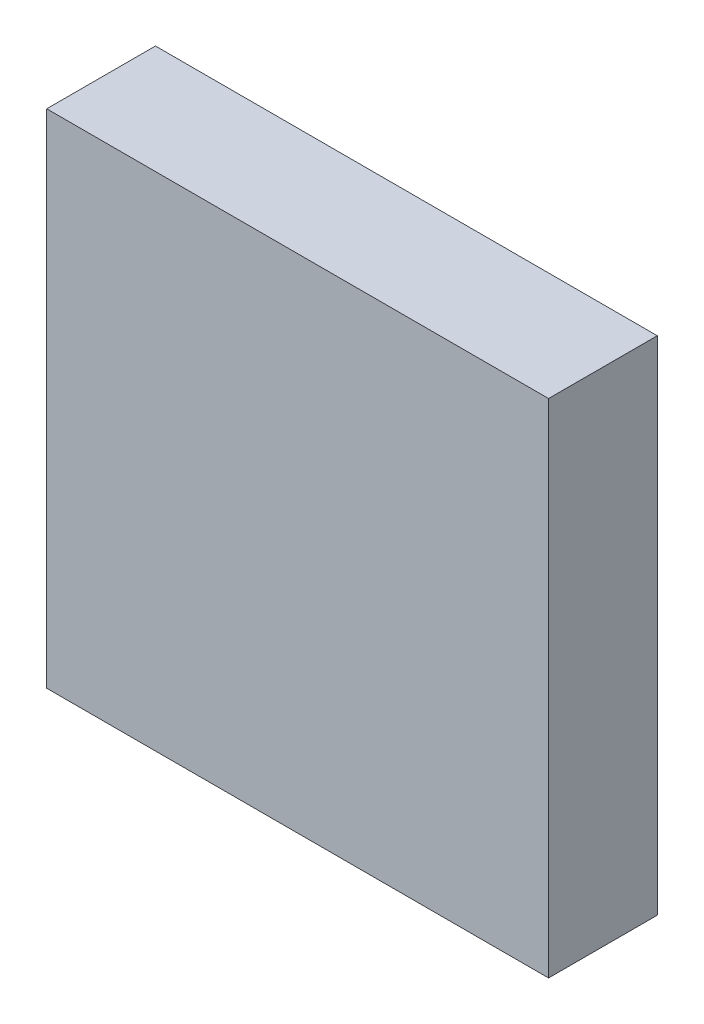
ISO-10303-21;
HEADER;
FILE_DESCRIPTION(('STEP AP214'),'2;1');
FILE_NAME('part.step','',(''),(''),'','','');
FILE_SCHEMA(('AUTOMOTIVE_DESIGN { 1 0 10303 214 1 1 1 1 }'));
ENDSEC;
DATA;
#1=APPLICATION_CONTEXT('core data for automotive mechanical design processes');
#2=APPLICATION_PROTOCOL_DEFINITION('international standard','automotive_design',2000,#1);
#3=PRODUCT_CONTEXT('',#1,'mechanical');
#4=PRODUCT('Part','Part','',(#3));
#5=PRODUCT_RELATED_PRODUCT_CATEGORY('part','',(#4));
#6=PRODUCT_DEFINITION_FORMATION('','',#4);
#7=PRODUCT_DEFINITION_CONTEXT('part definition',#1,'design');
#8=PRODUCT_DEFINITION('design','',#6,#7);
#9=PRODUCT_DEFINITION_SHAPE('','',#8);
#10=(LENGTH_UNIT() NAMED_UNIT(*) SI_UNIT(.MILLI.,.METRE.));
#11=(NAMED_UNIT(*) PLANE_ANGLE_UNIT() SI_UNIT($,.RADIAN.));
#12=(NAMED_UNIT(*) SI_UNIT($,.STERADIAN.) SOLID_ANGLE_UNIT());
#13=UNCERTAINTY_MEASURE_WITH_UNIT(LENGTH_MEASURE(1.E-05),#10,'distance_accuracy_value','');
#14=(GEOMETRIC_REPRESENTATION_CONTEXT(3) GLOBAL_UNCERTAINTY_ASSIGNED_CONTEXT((#13)) GLOBAL_UNIT_ASSIGNED_CONTEXT((#10,
#11,#12)) REPRESENTATION_CONTEXT('',''));
#15=CARTESIAN_POINT('',(0.,0.,0.));
#16=DIRECTION('',(0.,0.,1.));
#17=DIRECTION('',(1.,0.,0.));
#18=AXIS2_PLACEMENT_3D('',#15,#16,#17);
#19=CARTESIAN_POINT('',(3.,0.,0.65));
#20=DIRECTION('',(0.,0.,-1.));
#21=DIRECTION('',(-1.,0.,0.));
#22=AXIS2_PLACEMENT_3D('',#19,#20,#21);
#23=PLANE('',#22);
#24=DIRECTION('',(1.,0.,0.));
#25=VECTOR('',#24,1.);
#26=CARTESIAN_POINT('',(1.5,0.,0.65));
#27=LINE('',#26,#25);
#28=CARTESIAN_POINT('',(0.,0.,0.65));
#29=VERTEX_POINT('',#28);
#30=CARTESIAN_POINT('',(3.,0.,0.65));
#31=VERTEX_POINT('',#30);
#32=EDGE_CURVE('E80',#29,#31,#27,.T.);
#33=ORIENTED_EDGE('',*,*,#32,.T.);
#34=DIRECTION('',(0.,1.,0.));
#35=VECTOR('',#34,1.);
#36=CARTESIAN_POINT('',(3.,1.5,0.65));
#37=LINE('',#36,#35);
#38=CARTESIAN_POINT('',(3.,3.,0.65));
#39=VERTEX_POINT('',#38);
#40=EDGE_CURVE('E55',#31,#39,#37,.T.);
#41=ORIENTED_EDGE('',*,*,#40,.T.);
#42=DIRECTION('',(-1.,0.,0.));
#43=VECTOR('',#42,1.);
#44=CARTESIAN_POINT('',(1.5,3.,0.65));
#45=LINE('',#44,#43);
#46=CARTESIAN_POINT('',(0.,3.,0.65));
#47=VERTEX_POINT('',#46);
#48=EDGE_CURVE('E57',#39,#47,#45,.T.);
#49=ORIENTED_EDGE('',*,*,#48,.T.);
#50=DIRECTION('',(0.,-1.,0.));
#51=VECTOR('',#50,1.);
#52=CARTESIAN_POINT('',(0.,1.5,0.65));
#53=LINE('',#52,#51);
#54=EDGE_CURVE('E20',#47,#29,#53,.T.);
#55=ORIENTED_EDGE('',*,*,#54,.T.);
#56=EDGE_LOOP('',(#33,#41,#49,#55));
#57=FACE_BOUND('',#56,.T.);
#58=ADVANCED_FACE('F16',(#57),#23,.F.);
#59=CARTESIAN_POINT('',(0.,0.,0.));
#60=DIRECTION('',(1.,0.,0.));
#61=DIRECTION('',(0.,1.,0.));
#62=AXIS2_PLACEMENT_3D('',#59,#60,#61);
#63=PLANE('',#62);
#64=DIRECTION('',(0.,0.,1.));
#65=VECTOR('',#64,1.);
#66=CARTESIAN_POINT('',(0.,0.,0.325));
#67=LINE('',#66,#65);
#68=CARTESIAN_POINT('',(0.,0.,0.));
#69=VERTEX_POINT('',#68);
#70=EDGE_CURVE('E68',#69,#29,#67,.T.);
#71=ORIENTED_EDGE('',*,*,#70,.T.);
#72=ORIENTED_EDGE('',*,*,#54,.F.);
#73=DIRECTION('',(0.,0.,-1.));
#74=VECTOR('',#73,1.);
#75=CARTESIAN_POINT('',(0.,3.,0.325));
#76=LINE('',#75,#74);
#77=CARTESIAN_POINT('',(0.,3.,0.));
#78=VERTEX_POINT('',#77);
#79=EDGE_CURVE('E63',#47,#78,#76,.T.);
#80=ORIENTED_EDGE('',*,*,#79,.T.);
#81=DIRECTION('',(0.,1.,0.));
#82=VECTOR('',#81,1.);
#83=CARTESIAN_POINT('',(0.,1.5,0.));
#84=LINE('',#83,#82);
#85=EDGE_CURVE('E83',#69,#78,#84,.T.);
#86=ORIENTED_EDGE('',*,*,#85,.F.);
#87=EDGE_LOOP('',(#71,#72,#80,#86));
#88=FACE_BOUND('',#87,.T.);
#89=ADVANCED_FACE('F65',(#88),#63,.F.);
#90=CARTESIAN_POINT('',(0.,3.,0.65));
#91=DIRECTION('',(0.,-1.,0.));
#92=DIRECTION('',(0.,0.,-1.));
#93=AXIS2_PLACEMENT_3D('',#90,#91,#92);
#94=PLANE('',#93);
#95=ORIENTED_EDGE('',*,*,#79,.F.);
#96=ORIENTED_EDGE('',*,*,#48,.F.);
#97=DIRECTION('',(0.,0.,-1.));
#98=VECTOR('',#97,1.);
#99=CARTESIAN_POINT('',(3.,3.,0.325));
#100=LINE('',#99,#98);
#101=CARTESIAN_POINT('',(3.,3.,0.));
#102=VERTEX_POINT('',#101);
#103=EDGE_CURVE('E75',#39,#102,#100,.T.);
#104=ORIENTED_EDGE('',*,*,#103,.T.);
#105=DIRECTION('',(1.,0.,0.));
#106=VECTOR('',#105,1.);
#107=CARTESIAN_POINT('',(1.5,3.,0.));
#108=LINE('',#107,#106);
#109=EDGE_CURVE('E72',#78,#102,#108,.T.);
#110=ORIENTED_EDGE('',*,*,#109,.F.);
#111=EDGE_LOOP('',(#95,#96,#104,#110));
#112=FACE_BOUND('',#111,.T.);
#113=ADVANCED_FACE('F70',(#112),#94,.F.);
#114=CARTESIAN_POINT('',(3.,3.,0.));
#115=DIRECTION('',(-1.,0.,0.));
#116=DIRECTION('',(0.,-1.,0.));
#117=AXIS2_PLACEMENT_3D('',#114,#115,#116);
#118=PLANE('',#117);
#119=ORIENTED_EDGE('',*,*,#103,.F.);
#120=ORIENTED_EDGE('',*,*,#40,.F.);
#121=DIRECTION('',(0.,0.,-1.));
#122=VECTOR('',#121,1.);
#123=CARTESIAN_POINT('',(3.,0.,0.325));
#124=LINE('',#123,#122);
#125=CARTESIAN_POINT('',(3.,0.,0.));
#126=VERTEX_POINT('',#125);
#127=EDGE_CURVE('E35',#31,#126,#124,.T.);
#128=ORIENTED_EDGE('',*,*,#127,.T.);
#129=DIRECTION('',(0.,-1.,0.));
#130=VECTOR('',#129,1.);
#131=CARTESIAN_POINT('',(3.,1.5,0.));
#132=LINE('',#131,#130);
#133=EDGE_CURVE('E26',#102,#126,#132,.T.);
#134=ORIENTED_EDGE('',*,*,#133,.F.);
#135=EDGE_LOOP('',(#119,#120,#128,#134));
#136=FACE_BOUND('',#135,.T.);
#137=ADVANCED_FACE('F88',(#136),#118,.F.);
#138=CARTESIAN_POINT('',(0.,0.,0.));
#139=DIRECTION('',(0.,1.,0.));
#140=DIRECTION('',(0.,0.,1.));
#141=AXIS2_PLACEMENT_3D('',#138,#139,#140);
#142=PLANE('',#141);
#143=ORIENTED_EDGE('',*,*,#127,.F.);
#144=ORIENTED_EDGE('',*,*,#32,.F.);
#145=ORIENTED_EDGE('',*,*,#70,.F.);
#146=DIRECTION('',(-1.,0.,0.));
#147=VECTOR('',#146,1.);
#148=CARTESIAN_POINT('',(1.5,0.,0.));
#149=LINE('',#148,#147);
#150=EDGE_CURVE('E11',#126,#69,#149,.T.);
#151=ORIENTED_EDGE('',*,*,#150,.F.);
#152=EDGE_LOOP('',(#143,#144,#145,#151));
#153=FACE_BOUND('',#152,.T.);
#154=ADVANCED_FACE('F90',(#153),#142,.F.);
#155=CARTESIAN_POINT('',(3.,0.,0.));
#156=DIRECTION('',(0.,0.,-1.));
#157=DIRECTION('',(-1.,0.,0.));
#158=AXIS2_PLACEMENT_3D('',#155,#156,#157);
#159=PLANE('',#158);
#160=ORIENTED_EDGE('',*,*,#133,.T.);
#161=ORIENTED_EDGE('',*,*,#150,.T.);
#162=ORIENTED_EDGE('',*,*,#85,.T.);
#163=ORIENTED_EDGE('',*,*,#109,.T.);
#164=EDGE_LOOP('',(#160,#161,#162,#163));
#165=FACE_BOUND('',#164,.T.);
#166=ADVANCED_FACE('F18',(#165),#159,.T.);
#167=CLOSED_SHELL('',(#58,#89,#113,#137,#154,#166));
#168=MANIFOLD_SOLID_BREP('B1',#167);
#169=ADVANCED_BREP_SHAPE_REPRESENTATION('',(#18,#168),#14);
#170=SHAPE_DEFINITION_REPRESENTATION(#9,#169);
ENDSEC;
END-ISO-10303-21;
